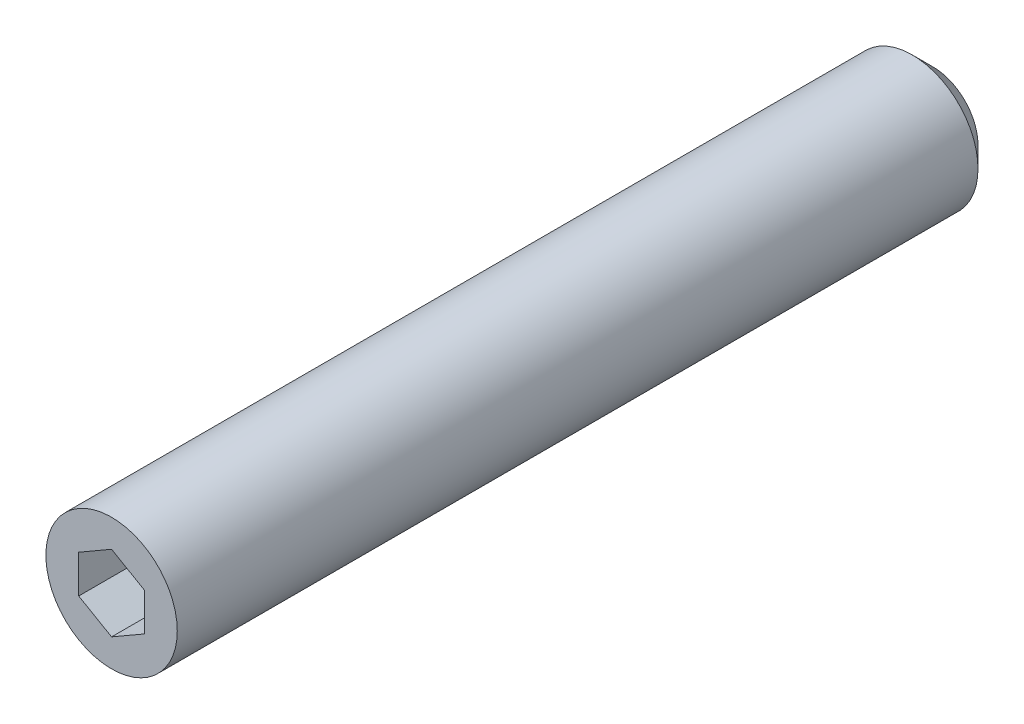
ISO-10303-21;
HEADER;
FILE_DESCRIPTION(('STEP AP214'),'2;1');
FILE_NAME('part.step','',(''),(''),'','','');
FILE_SCHEMA(('AUTOMOTIVE_DESIGN { 1 0 10303 214 1 1 1 1 }'));
ENDSEC;
DATA;
#1=APPLICATION_CONTEXT('core data for automotive mechanical design processes');
#2=APPLICATION_PROTOCOL_DEFINITION('international standard','automotive_design',2000,#1);
#3=PRODUCT_CONTEXT('',#1,'mechanical');
#4=PRODUCT('Part','Part','',(#3));
#5=PRODUCT_RELATED_PRODUCT_CATEGORY('part','',(#4));
#6=PRODUCT_DEFINITION_FORMATION('','',#4);
#7=PRODUCT_DEFINITION_CONTEXT('part definition',#1,'design');
#8=PRODUCT_DEFINITION('design','',#6,#7);
#9=PRODUCT_DEFINITION_SHAPE('','',#8);
#10=(LENGTH_UNIT() NAMED_UNIT(*) SI_UNIT(.MILLI.,.METRE.));
#11=(NAMED_UNIT(*) PLANE_ANGLE_UNIT() SI_UNIT($,.RADIAN.));
#12=(NAMED_UNIT(*) SI_UNIT($,.STERADIAN.) SOLID_ANGLE_UNIT());
#13=UNCERTAINTY_MEASURE_WITH_UNIT(LENGTH_MEASURE(1.E-05),#10,'distance_accuracy_value','');
#14=(GEOMETRIC_REPRESENTATION_CONTEXT(3) GLOBAL_UNCERTAINTY_ASSIGNED_CONTEXT((#13)) GLOBAL_UNIT_ASSIGNED_CONTEXT((#10,
#11,#12)) REPRESENTATION_CONTEXT('',''));
#15=CARTESIAN_POINT('',(0.,0.,0.));
#16=DIRECTION('',(0.,0.,1.));
#17=DIRECTION('',(1.,0.,0.));
#18=AXIS2_PLACEMENT_3D('',#15,#16,#17);
#19=CARTESIAN_POINT('',(0.,2.30940107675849,47.));
#20=DIRECTION('',(-0.5,-0.866025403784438,0.));
#21=DIRECTION('',(0.866025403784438,-0.5,0.));
#22=AXIS2_PLACEMENT_3D('',#19,#20,#21);
#23=PLANE('',#22);
#24=DIRECTION('',(0.,0.,1.));
#25=VECTOR('',#24,1.);
#26=CARTESIAN_POINT('',(2.,1.15470053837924,47.));
#27=LINE('',#26,#25);
#28=CARTESIAN_POINT('',(2.,1.15470053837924,47.));
#29=VERTEX_POINT('',#28);
#30=CARTESIAN_POINT('',(2.,1.15470053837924,50.));
#31=VERTEX_POINT('',#30);
#32=EDGE_CURVE('E63',#29,#31,#27,.T.);
#33=ORIENTED_EDGE('',*,*,#32,.T.);
#34=DIRECTION('',(0.866025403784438,-0.5,0.));
#35=VECTOR('',#34,1.);
#36=CARTESIAN_POINT('',(0.,2.30940107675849,50.));
#37=LINE('',#36,#35);
#38=CARTESIAN_POINT('',(0.,2.30940107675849,50.));
#39=VERTEX_POINT('',#38);
#40=EDGE_CURVE('E29',#39,#31,#37,.T.);
#41=ORIENTED_EDGE('',*,*,#40,.F.);
#42=DIRECTION('',(0.,0.,1.));
#43=VECTOR('',#42,1.);
#44=CARTESIAN_POINT('',(0.,2.30940107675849,47.));
#45=LINE('',#44,#43);
#46=CARTESIAN_POINT('',(0.,2.30940107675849,47.));
#47=VERTEX_POINT('',#46);
#48=EDGE_CURVE('E33',#47,#39,#45,.T.);
#49=ORIENTED_EDGE('',*,*,#48,.F.);
#50=DIRECTION('',(0.866025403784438,-0.5,0.));
#51=VECTOR('',#50,1.);
#52=CARTESIAN_POINT('',(0.,2.30940107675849,47.));
#53=LINE('',#52,#51);
#54=EDGE_CURVE('E65',#47,#29,#53,.T.);
#55=ORIENTED_EDGE('',*,*,#54,.T.);
#56=EDGE_LOOP('',(#33,#41,#49,#55));
#57=FACE_BOUND('',#56,.T.);
#58=ADVANCED_FACE('F14',(#57),#23,.T.);
#59=CARTESIAN_POINT('',(2.,1.15470053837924,47.));
#60=DIRECTION('',(-1.,0.,0.));
#61=DIRECTION('',(0.,-1.,0.));
#62=AXIS2_PLACEMENT_3D('',#59,#60,#61);
#63=PLANE('',#62);
#64=DIRECTION('',(0.,0.,1.));
#65=VECTOR('',#64,1.);
#66=CARTESIAN_POINT('',(2.,-1.15470053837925,47.));
#67=LINE('',#66,#65);
#68=CARTESIAN_POINT('',(2.,-1.15470053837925,47.));
#69=VERTEX_POINT('',#68);
#70=CARTESIAN_POINT('',(2.,-1.15470053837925,50.));
#71=VERTEX_POINT('',#70);
#72=EDGE_CURVE('E70',#69,#71,#67,.T.);
#73=ORIENTED_EDGE('',*,*,#72,.T.);
#74=DIRECTION('',(0.,-1.,0.));
#75=VECTOR('',#74,1.);
#76=CARTESIAN_POINT('',(2.,1.15470053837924,50.));
#77=LINE('',#76,#75);
#78=EDGE_CURVE('E73',#31,#71,#77,.T.);
#79=ORIENTED_EDGE('',*,*,#78,.F.);
#80=ORIENTED_EDGE('',*,*,#32,.F.);
#81=DIRECTION('',(0.,-1.,0.));
#82=VECTOR('',#81,1.);
#83=CARTESIAN_POINT('',(2.,1.15470053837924,47.));
#84=LINE('',#83,#82);
#85=EDGE_CURVE('E100',#29,#69,#84,.T.);
#86=ORIENTED_EDGE('',*,*,#85,.T.);
#87=EDGE_LOOP('',(#73,#79,#80,#86));
#88=FACE_BOUND('',#87,.T.);
#89=ADVANCED_FACE('F74',(#88),#63,.T.);
#90=CARTESIAN_POINT('',(0.,-2.30940107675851,47.));
#91=DIRECTION('',(0.5,-0.866025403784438,0.));
#92=DIRECTION('',(0.866025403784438,0.5,0.));
#93=AXIS2_PLACEMENT_3D('',#90,#91,#92);
#94=PLANE('',#93);
#95=DIRECTION('',(0.,0.,1.));
#96=VECTOR('',#95,1.);
#97=CARTESIAN_POINT('',(0.,-2.30940107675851,47.));
#98=LINE('',#97,#96);
#99=CARTESIAN_POINT('',(0.,-2.30940107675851,47.));
#100=VERTEX_POINT('',#99);
#101=CARTESIAN_POINT('',(0.,-2.30940107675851,50.));
#102=VERTEX_POINT('',#101);
#103=EDGE_CURVE('E108',#100,#102,#98,.T.);
#104=ORIENTED_EDGE('',*,*,#103,.T.);
#105=DIRECTION('',(0.866025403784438,0.5,0.));
#106=VECTOR('',#105,1.);
#107=CARTESIAN_POINT('',(0.,-2.30940107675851,50.));
#108=LINE('',#107,#106);
#109=EDGE_CURVE('E78',#102,#71,#108,.T.);
#110=ORIENTED_EDGE('',*,*,#109,.T.);
#111=ORIENTED_EDGE('',*,*,#72,.F.);
#112=DIRECTION('',(0.866025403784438,0.5,0.));
#113=VECTOR('',#112,1.);
#114=CARTESIAN_POINT('',(0.,-2.30940107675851,47.));
#115=LINE('',#114,#113);
#116=EDGE_CURVE('E97',#100,#69,#115,.T.);
#117=ORIENTED_EDGE('',*,*,#116,.F.);
#118=EDGE_LOOP('',(#104,#110,#111,#117));
#119=FACE_BOUND('',#118,.T.);
#120=ADVANCED_FACE('F135',(#119),#94,.F.);
#121=CARTESIAN_POINT('',(0.,-2.30940107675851,47.));
#122=DIRECTION('',(0.5,0.866025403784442,0.));
#123=DIRECTION('',(-0.866025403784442,0.5,0.));
#124=AXIS2_PLACEMENT_3D('',#121,#122,#123);
#125=PLANE('',#124);
#126=DIRECTION('',(0.,0.,1.));
#127=VECTOR('',#126,1.);
#128=CARTESIAN_POINT('',(-2.,-1.15470053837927,47.));
#129=LINE('',#128,#127);
#130=CARTESIAN_POINT('',(-2.,-1.15470053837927,47.));
#131=VERTEX_POINT('',#130);
#132=CARTESIAN_POINT('',(-2.,-1.15470053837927,50.));
#133=VERTEX_POINT('',#132);
#134=EDGE_CURVE('E106',#131,#133,#129,.T.);
#135=ORIENTED_EDGE('',*,*,#134,.T.);
#136=DIRECTION('',(-0.866025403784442,0.5,0.));
#137=VECTOR('',#136,1.);
#138=CARTESIAN_POINT('',(0.,-2.30940107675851,50.));
#139=LINE('',#138,#137);
#140=EDGE_CURVE('E173',#102,#133,#139,.T.);
#141=ORIENTED_EDGE('',*,*,#140,.F.);
#142=ORIENTED_EDGE('',*,*,#103,.F.);
#143=DIRECTION('',(-0.866025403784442,0.5,0.));
#144=VECTOR('',#143,1.);
#145=CARTESIAN_POINT('',(0.,-2.30940107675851,47.));
#146=LINE('',#145,#144);
#147=EDGE_CURVE('E94',#100,#131,#146,.T.);
#148=ORIENTED_EDGE('',*,*,#147,.T.);
#149=EDGE_LOOP('',(#135,#141,#142,#148));
#150=FACE_BOUND('',#149,.T.);
#151=ADVANCED_FACE('F147',(#150),#125,.T.);
#152=CARTESIAN_POINT('',(-2.,1.15470053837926,47.));
#153=DIRECTION('',(-1.,0.,0.));
#154=DIRECTION('',(0.,0.,1.));
#155=AXIS2_PLACEMENT_3D('',#152,#153,#154);
#156=PLANE('',#155);
#157=DIRECTION('',(0.,0.,1.));
#158=VECTOR('',#157,1.);
#159=CARTESIAN_POINT('',(-2.,1.15470053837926,47.));
#160=LINE('',#159,#158);
#161=CARTESIAN_POINT('',(-2.,1.15470053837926,47.));
#162=VERTEX_POINT('',#161);
#163=CARTESIAN_POINT('',(-2.,1.15470053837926,50.));
#164=VERTEX_POINT('',#163);
#165=EDGE_CURVE('E104',#162,#164,#160,.T.);
#166=ORIENTED_EDGE('',*,*,#165,.T.);
#167=DIRECTION('',(0.,-1.,0.));
#168=VECTOR('',#167,1.);
#169=CARTESIAN_POINT('',(-2.,1.15470053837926,50.));
#170=LINE('',#169,#168);
#171=EDGE_CURVE('E174',#164,#133,#170,.T.);
#172=ORIENTED_EDGE('',*,*,#171,.T.);
#173=ORIENTED_EDGE('',*,*,#134,.F.);
#174=DIRECTION('',(0.,-1.,0.));
#175=VECTOR('',#174,1.);
#176=CARTESIAN_POINT('',(-2.,1.15470053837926,47.));
#177=LINE('',#176,#175);
#178=EDGE_CURVE('E91',#162,#131,#177,.T.);
#179=ORIENTED_EDGE('',*,*,#178,.F.);
#180=EDGE_LOOP('',(#166,#172,#173,#179));
#181=FACE_BOUND('',#180,.T.);
#182=ADVANCED_FACE('F143',(#181),#156,.F.);
#183=CARTESIAN_POINT('',(0.,2.30940107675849,47.));
#184=DIRECTION('',(-0.499999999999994,0.866025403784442,0.));
#185=DIRECTION('',(-0.866025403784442,-0.499999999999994,0.));
#186=AXIS2_PLACEMENT_3D('',#183,#184,#185);
#187=PLANE('',#186);
#188=DIRECTION('',(-0.866025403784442,-0.499999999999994,0.));
#189=VECTOR('',#188,1.);
#190=CARTESIAN_POINT('',(0.,2.30940107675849,47.));
#191=LINE('',#190,#189);
#192=EDGE_CURVE('E88',#47,#162,#191,.T.);
#193=ORIENTED_EDGE('',*,*,#192,.F.);
#194=ORIENTED_EDGE('',*,*,#48,.T.);
#195=DIRECTION('',(-0.866025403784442,-0.499999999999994,0.));
#196=VECTOR('',#195,1.);
#197=CARTESIAN_POINT('',(0.,2.30940107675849,50.));
#198=LINE('',#197,#196);
#199=EDGE_CURVE('E84',#39,#164,#198,.T.);
#200=ORIENTED_EDGE('',*,*,#199,.T.);
#201=ORIENTED_EDGE('',*,*,#165,.F.);
#202=EDGE_LOOP('',(#193,#194,#200,#201));
#203=FACE_BOUND('',#202,.T.);
#204=ADVANCED_FACE('F140',(#203),#187,.F.);
#205=CARTESIAN_POINT('',(4.,0.,47.));
#206=DIRECTION('',(0.,0.,1.));
#207=DIRECTION('',(1.,0.,0.));
#208=AXIS2_PLACEMENT_3D('',#205,#206,#207);
#209=PLANE('',#208);
#210=ORIENTED_EDGE('',*,*,#54,.F.);
#211=ORIENTED_EDGE('',*,*,#192,.T.);
#212=ORIENTED_EDGE('',*,*,#178,.T.);
#213=ORIENTED_EDGE('',*,*,#147,.F.);
#214=ORIENTED_EDGE('',*,*,#116,.T.);
#215=ORIENTED_EDGE('',*,*,#85,.F.);
#216=EDGE_LOOP('',(#210,#211,#212,#213,#214,#215));
#217=FACE_BOUND('',#216,.T.);
#218=ADVANCED_FACE('F139',(#217),#209,.T.);
#219=CARTESIAN_POINT('',(4.,0.,50.));
#220=DIRECTION('',(0.,0.,-1.));
#221=DIRECTION('',(-1.,0.,0.));
#222=AXIS2_PLACEMENT_3D('',#219,#220,#221);
#223=PLANE('',#222);
#224=CARTESIAN_POINT('',(0.,0.,50.));
#225=DIRECTION('',(0.,0.,1.));
#226=DIRECTION('',(1.,0.,0.));
#227=AXIS2_PLACEMENT_3D('',#224,#225,#226);
#228=CIRCLE('',#227,4.);
#229=CARTESIAN_POINT('',(4.,0.,50.));
#230=VERTEX_POINT('',#229);
#231=EDGE_CURVE('E69',#230,#230,#228,.T.);
#232=ORIENTED_EDGE('',*,*,#231,.T.);
#233=EDGE_LOOP('',(#232));
#234=FACE_BOUND('',#233,.T.);
#235=ORIENTED_EDGE('',*,*,#40,.T.);
#236=ORIENTED_EDGE('',*,*,#78,.T.);
#237=ORIENTED_EDGE('',*,*,#109,.F.);
#238=ORIENTED_EDGE('',*,*,#140,.T.);
#239=ORIENTED_EDGE('',*,*,#171,.F.);
#240=ORIENTED_EDGE('',*,*,#199,.F.);
#241=EDGE_LOOP('',(#235,#236,#237,#238,#239,#240));
#242=FACE_BOUND('',#241,.T.);
#243=ADVANCED_FACE('F81',(#234,#242),#223,.F.);
#244=CARTESIAN_POINT('',(0.,0.,0.));
#245=DIRECTION('',(0.,0.,1.));
#246=DIRECTION('',(1.,0.,0.));
#247=AXIS2_PLACEMENT_3D('',#244,#245,#246);
#248=PLANE('',#247);
#249=CARTESIAN_POINT('',(0.,0.,0.));
#250=DIRECTION('',(0.,0.,1.));
#251=DIRECTION('',(1.,0.,0.));
#252=AXIS2_PLACEMENT_3D('',#249,#250,#251);
#253=CIRCLE('',#252,2.75);
#254=CARTESIAN_POINT('',(2.75,0.,0.));
#255=VERTEX_POINT('',#254);
#256=EDGE_CURVE('E9',#255,#255,#253,.T.);
#257=ORIENTED_EDGE('',*,*,#256,.F.);
#258=EDGE_LOOP('',(#257));
#259=FACE_BOUND('',#258,.T.);
#260=ADVANCED_FACE('F16',(#259),#248,.F.);
#261=CARTESIAN_POINT('',(0.,0.,1.25000000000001));
#262=DIRECTION('',(0.,0.,1.));
#263=DIRECTION('',(1.,0.,0.));
#264=AXIS2_PLACEMENT_3D('',#261,#262,#263);
#265=CONICAL_SURFACE('',#264,4.,0.785398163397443);
#266=ORIENTED_EDGE('',*,*,#256,.T.);
#267=EDGE_LOOP('',(#266));
#268=FACE_BOUND('',#267,.T.);
#269=CARTESIAN_POINT('',(0.,0.,1.25000000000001));
#270=DIRECTION('',(0.,0.,1.));
#271=DIRECTION('',(1.,0.,0.));
#272=AXIS2_PLACEMENT_3D('',#269,#270,#271);
#273=CIRCLE('',#272,4.);
#274=CARTESIAN_POINT('',(4.,0.,1.25000000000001));
#275=VERTEX_POINT('',#274);
#276=EDGE_CURVE('E22',#275,#275,#273,.T.);
#277=ORIENTED_EDGE('',*,*,#276,.F.);
#278=EDGE_LOOP('',(#277));
#279=FACE_BOUND('',#278,.T.);
#280=ADVANCED_FACE('F117',(#268,#279),#265,.T.);
#281=CARTESIAN_POINT('',(0.,0.,20.));
#282=DIRECTION('',(0.,0.,1.));
#283=DIRECTION('',(1.,0.,0.));
#284=AXIS2_PLACEMENT_3D('',#281,#282,#283);
#285=CYLINDRICAL_SURFACE('',#284,4.);
#286=ORIENTED_EDGE('',*,*,#231,.F.);
#287=EDGE_LOOP('',(#286));
#288=FACE_BOUND('',#287,.T.);
#289=ORIENTED_EDGE('',*,*,#276,.T.);
#290=EDGE_LOOP('',(#289));
#291=FACE_BOUND('',#290,.T.);
#292=ADVANCED_FACE('F115',(#288,#291),#285,.T.);
#293=CLOSED_SHELL('',(#58,#89,#120,#151,#182,#204,#218,#243,#260,#280,#292));
#294=MANIFOLD_SOLID_BREP('B1',#293);
#295=ADVANCED_BREP_SHAPE_REPRESENTATION('',(#18,#294),#14);
#296=SHAPE_DEFINITION_REPRESENTATION(#9,#295);
ENDSEC;
END-ISO-10303-21;
